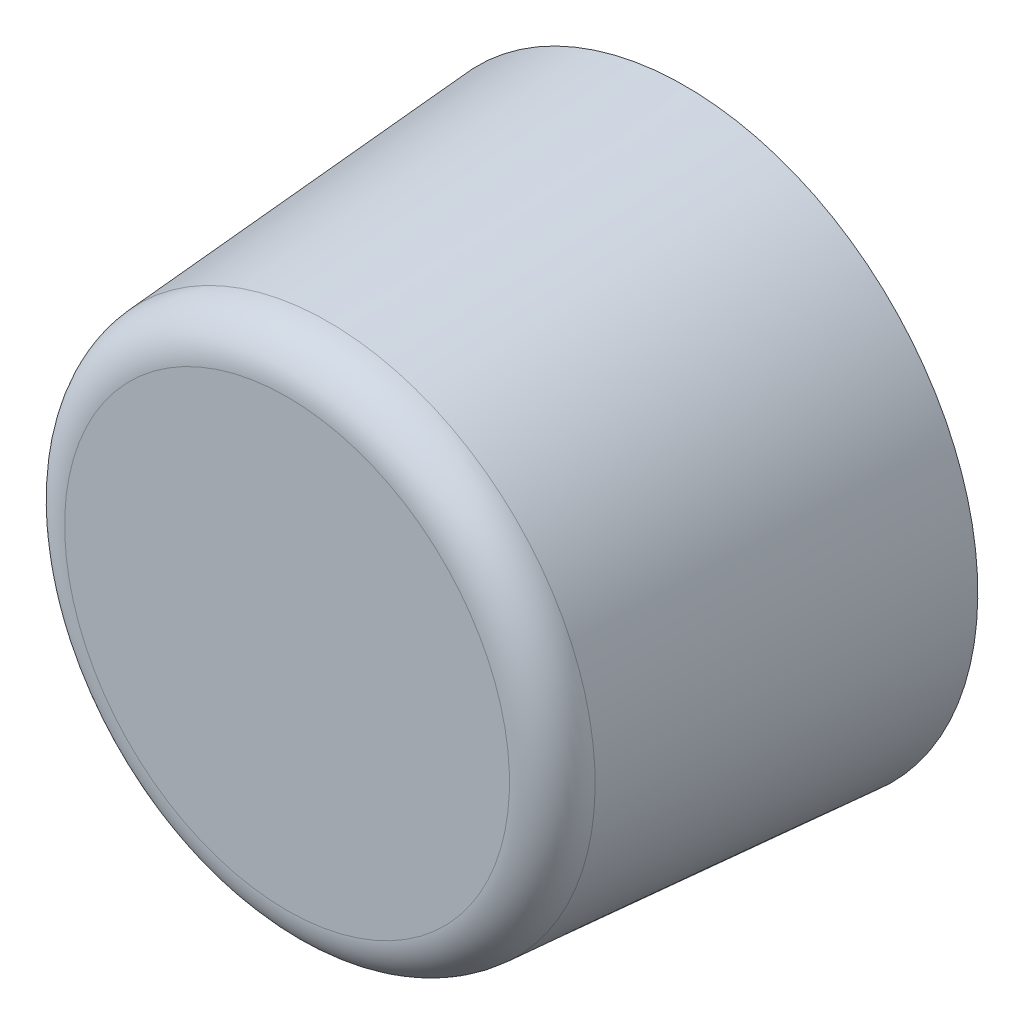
ISO-10303-21;
HEADER;
FILE_DESCRIPTION(('STEP AP214'),'2;1');
FILE_NAME('part.step','',(''),(''),'','','');
FILE_SCHEMA(('AUTOMOTIVE_DESIGN { 1 0 10303 214 1 1 1 1 }'));
ENDSEC;
DATA;
#1=APPLICATION_CONTEXT('core data for automotive mechanical design processes');
#2=APPLICATION_PROTOCOL_DEFINITION('international standard','automotive_design',2000,#1);
#3=PRODUCT_CONTEXT('',#1,'mechanical');
#4=PRODUCT('Part','Part','',(#3));
#5=PRODUCT_RELATED_PRODUCT_CATEGORY('part','',(#4));
#6=PRODUCT_DEFINITION_FORMATION('','',#4);
#7=PRODUCT_DEFINITION_CONTEXT('part definition',#1,'design');
#8=PRODUCT_DEFINITION('design','',#6,#7);
#9=PRODUCT_DEFINITION_SHAPE('','',#8);
#10=(LENGTH_UNIT() NAMED_UNIT(*) SI_UNIT(.MILLI.,.METRE.));
#11=(NAMED_UNIT(*) PLANE_ANGLE_UNIT() SI_UNIT($,.RADIAN.));
#12=(NAMED_UNIT(*) SI_UNIT($,.STERADIAN.) SOLID_ANGLE_UNIT());
#13=UNCERTAINTY_MEASURE_WITH_UNIT(LENGTH_MEASURE(1.E-05),#10,'distance_accuracy_value','');
#14=(GEOMETRIC_REPRESENTATION_CONTEXT(3) GLOBAL_UNCERTAINTY_ASSIGNED_CONTEXT((#13)) GLOBAL_UNIT_ASSIGNED_CONTEXT((#10,
#11,#12)) REPRESENTATION_CONTEXT('',''));
#15=CARTESIAN_POINT('',(0.,0.,0.));
#16=DIRECTION('',(0.,0.,1.));
#17=DIRECTION('',(1.,0.,0.));
#18=AXIS2_PLACEMENT_3D('',#15,#16,#17);
#19=CARTESIAN_POINT('',(0.,0.,17.));
#20=DIRECTION('',(0.,0.,1.));
#21=DIRECTION('',(0.,-1.,0.));
#22=AXIS2_PLACEMENT_3D('',#19,#20,#21);
#23=CYLINDRICAL_SURFACE('',#22,11.25);
#24=CARTESIAN_POINT('',(0.,0.,0.));
#25=DIRECTION('',(0.,0.,1.));
#26=DIRECTION('',(0.,-1.,0.));
#27=AXIS2_PLACEMENT_3D('',#24,#25,#26);
#28=CIRCLE('',#27,11.25);
#29=CARTESIAN_POINT('',(0.,-11.25,0.));
#30=VERTEX_POINT('',#29);
#31=EDGE_CURVE('E8',#30,#30,#28,.T.);
#32=ORIENTED_EDGE('',*,*,#31,.F.);
#33=EDGE_LOOP('',(#32));
#34=FACE_BOUND('',#33,.T.);
#35=CARTESIAN_POINT('',(0.,0.,0.0500000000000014));
#36=DIRECTION('',(0.,0.,1.));
#37=DIRECTION('',(0.,-1.,0.));
#38=AXIS2_PLACEMENT_3D('',#35,#36,#37);
#39=CIRCLE('',#38,11.25);
#40=CARTESIAN_POINT('',(0.,-11.25,0.0500000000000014));
#41=VERTEX_POINT('',#40);
#42=EDGE_CURVE('E34',#41,#41,#39,.T.);
#43=ORIENTED_EDGE('',*,*,#42,.T.);
#44=EDGE_LOOP('',(#43));
#45=FACE_BOUND('',#44,.T.);
#46=ADVANCED_FACE('F12',(#34,#45),#23,.F.);
#47=CARTESIAN_POINT('',(11.25,0.,0.));
#48=DIRECTION('',(0.,0.,1.));
#49=DIRECTION('',(0.,-1.,0.));
#50=AXIS2_PLACEMENT_3D('',#47,#48,#49);
#51=PLANE('',#50);
#52=CARTESIAN_POINT('',(0.,0.,0.));
#53=DIRECTION('',(0.,0.,1.));
#54=DIRECTION('',(0.,-1.,0.));
#55=AXIS2_PLACEMENT_3D('',#52,#53,#54);
#56=CIRCLE('',#55,12.5);
#57=CARTESIAN_POINT('',(0.,-12.5,0.));
#58=VERTEX_POINT('',#57);
#59=EDGE_CURVE('E18',#58,#58,#56,.T.);
#60=ORIENTED_EDGE('',*,*,#59,.F.);
#61=EDGE_LOOP('',(#60));
#62=FACE_BOUND('',#61,.T.);
#63=ORIENTED_EDGE('',*,*,#31,.T.);
#64=EDGE_LOOP('',(#63));
#65=FACE_BOUND('',#64,.T.);
#66=ADVANCED_FACE('F70',(#62,#65),#51,.F.);
#67=CARTESIAN_POINT('',(0.,0.,0.));
#68=DIRECTION('',(0.,0.,-1.));
#69=DIRECTION('',(0.,1.,0.));
#70=AXIS2_PLACEMENT_3D('',#67,#68,#69);
#71=CONICAL_SURFACE('',#70,12.5,0.0723905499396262);
#72=CARTESIAN_POINT('',(0.,0.,15.2374219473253));
#73=DIRECTION('',(0.,0.,1.));
#74=DIRECTION('',(0.,-1.,0.));
#75=AXIS2_PLACEMENT_3D('',#72,#73,#74);
#76=CIRCLE('',#75,11.3950238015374);
#77=CARTESIAN_POINT('',(0.,-11.3950238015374,15.2374219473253));
#78=VERTEX_POINT('',#77);
#79=EDGE_CURVE('E22',#78,#78,#76,.T.);
#80=ORIENTED_EDGE('',*,*,#79,.F.);
#81=EDGE_LOOP('',(#80));
#82=FACE_BOUND('',#81,.T.);
#83=ORIENTED_EDGE('',*,*,#59,.T.);
#84=EDGE_LOOP('',(#83));
#85=FACE_BOUND('',#84,.T.);
#86=ADVANCED_FACE('F75',(#82,#85),#71,.T.);
#87=CARTESIAN_POINT('',(0.,0.,15.1));
#88=DIRECTION('',(0.,0.,1.));
#89=DIRECTION('',(0.,-1.,0.));
#90=AXIS2_PLACEMENT_3D('',#87,#88,#89);
#91=TOROIDAL_SURFACE('',#90,9.5,1.9);
#92=ORIENTED_EDGE('',*,*,#79,.T.);
#93=EDGE_LOOP('',(#92));
#94=FACE_BOUND('',#93,.T.);
#95=CARTESIAN_POINT('',(0.,0.,17.));
#96=DIRECTION('',(0.,0.,1.));
#97=DIRECTION('',(0.,-1.,0.));
#98=AXIS2_PLACEMENT_3D('',#95,#96,#97);
#99=CIRCLE('',#98,9.5);
#100=CARTESIAN_POINT('',(0.,-9.5,17.));
#101=VERTEX_POINT('',#100);
#102=EDGE_CURVE('E26',#101,#101,#99,.T.);
#103=ORIENTED_EDGE('',*,*,#102,.F.);
#104=EDGE_LOOP('',(#103));
#105=FACE_BOUND('',#104,.T.);
#106=ADVANCED_FACE('F65',(#94,#105),#91,.T.);
#107=CARTESIAN_POINT('',(9.5,0.,17.));
#108=DIRECTION('',(0.,0.,-1.));
#109=DIRECTION('',(0.,1.,0.));
#110=AXIS2_PLACEMENT_3D('',#107,#108,#109);
#111=PLANE('',#110);
#112=ORIENTED_EDGE('',*,*,#102,.T.);
#113=EDGE_LOOP('',(#112));
#114=FACE_BOUND('',#113,.T.);
#115=ADVANCED_FACE('F55',(#114),#111,.F.);
#116=CARTESIAN_POINT('',(0.,0.,0.));
#117=DIRECTION('',(0.,0.,1.));
#118=DIRECTION('',(0.,-1.,0.));
#119=AXIS2_PLACEMENT_3D('',#116,#117,#118);
#120=PLANE('',#119);
#121=CARTESIAN_POINT('',(0.,0.,0.));
#122=DIRECTION('',(0.,0.,1.));
#123=DIRECTION('',(0.,-1.,0.));
#124=AXIS2_PLACEMENT_3D('',#121,#122,#123);
#125=CIRCLE('',#124,11.2);
#126=CARTESIAN_POINT('',(0.,-11.2,0.));
#127=VERTEX_POINT('',#126);
#128=EDGE_CURVE('E31',#127,#127,#125,.T.);
#129=ORIENTED_EDGE('',*,*,#128,.F.);
#130=EDGE_LOOP('',(#129));
#131=FACE_BOUND('',#130,.T.);
#132=CARTESIAN_POINT('',(0.,0.,0.));
#133=DIRECTION('',(0.,0.,-1.));
#134=DIRECTION('',(0.,1.,0.));
#135=AXIS2_PLACEMENT_3D('',#132,#133,#134);
#136=CIRCLE('',#135,3.);
#137=CARTESIAN_POINT('',(0.,3.,0.));
#138=VERTEX_POINT('',#137);
#139=EDGE_CURVE('E38',#138,#138,#136,.T.);
#140=ORIENTED_EDGE('',*,*,#139,.F.);
#141=EDGE_LOOP('',(#140));
#142=FACE_BOUND('',#141,.T.);
#143=ADVANCED_FACE('F53',(#131,#142),#120,.F.);
#144=CARTESIAN_POINT('',(0.,0.,0.));
#145=DIRECTION('',(0.,0.,1.));
#146=DIRECTION('',(0.,-1.,0.));
#147=AXIS2_PLACEMENT_3D('',#144,#145,#146);
#148=CONICAL_SURFACE('',#147,11.2,0.785398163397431);
#149=ORIENTED_EDGE('',*,*,#42,.F.);
#150=EDGE_LOOP('',(#149));
#151=FACE_BOUND('',#150,.T.);
#152=ORIENTED_EDGE('',*,*,#128,.T.);
#153=EDGE_LOOP('',(#152));
#154=FACE_BOUND('',#153,.T.);
#155=ADVANCED_FACE('F49',(#151,#154),#148,.T.);
#156=CARTESIAN_POINT('',(0.,0.,6.));
#157=DIRECTION('',(0.,0.,-1.));
#158=DIRECTION('',(0.,1.,0.));
#159=AXIS2_PLACEMENT_3D('',#156,#157,#158);
#160=CYLINDRICAL_SURFACE('',#159,3.);
#161=CARTESIAN_POINT('',(0.,0.,6.));
#162=DIRECTION('',(0.,0.,-1.));
#163=DIRECTION('',(0.,1.,0.));
#164=AXIS2_PLACEMENT_3D('',#161,#162,#163);
#165=CIRCLE('',#164,3.);
#166=CARTESIAN_POINT('',(0.,3.,6.));
#167=VERTEX_POINT('',#166);
#168=EDGE_CURVE('E37',#167,#167,#165,.T.);
#169=ORIENTED_EDGE('',*,*,#168,.F.);
#170=EDGE_LOOP('',(#169));
#171=FACE_BOUND('',#170,.T.);
#172=ORIENTED_EDGE('',*,*,#139,.T.);
#173=EDGE_LOOP('',(#172));
#174=FACE_BOUND('',#173,.T.);
#175=ADVANCED_FACE('F46',(#171,#174),#160,.F.);
#176=CARTESIAN_POINT('',(0.,0.,6.));
#177=DIRECTION('',(0.,0.,-1.));
#178=DIRECTION('',(0.,1.,0.));
#179=AXIS2_PLACEMENT_3D('',#176,#177,#178);
#180=PLANE('',#179);
#181=ORIENTED_EDGE('',*,*,#168,.T.);
#182=EDGE_LOOP('',(#181));
#183=FACE_BOUND('',#182,.T.);
#184=ADVANCED_FACE('F44',(#183),#180,.T.);
#185=CLOSED_SHELL('',(#46,#66,#86,#106,#115,#143,#155,#175,#184));
#186=MANIFOLD_SOLID_BREP('B1',#185);
#187=ADVANCED_BREP_SHAPE_REPRESENTATION('',(#18,#186),#14);
#188=SHAPE_DEFINITION_REPRESENTATION(#9,#187);
ENDSEC;
END-ISO-10303-21;
